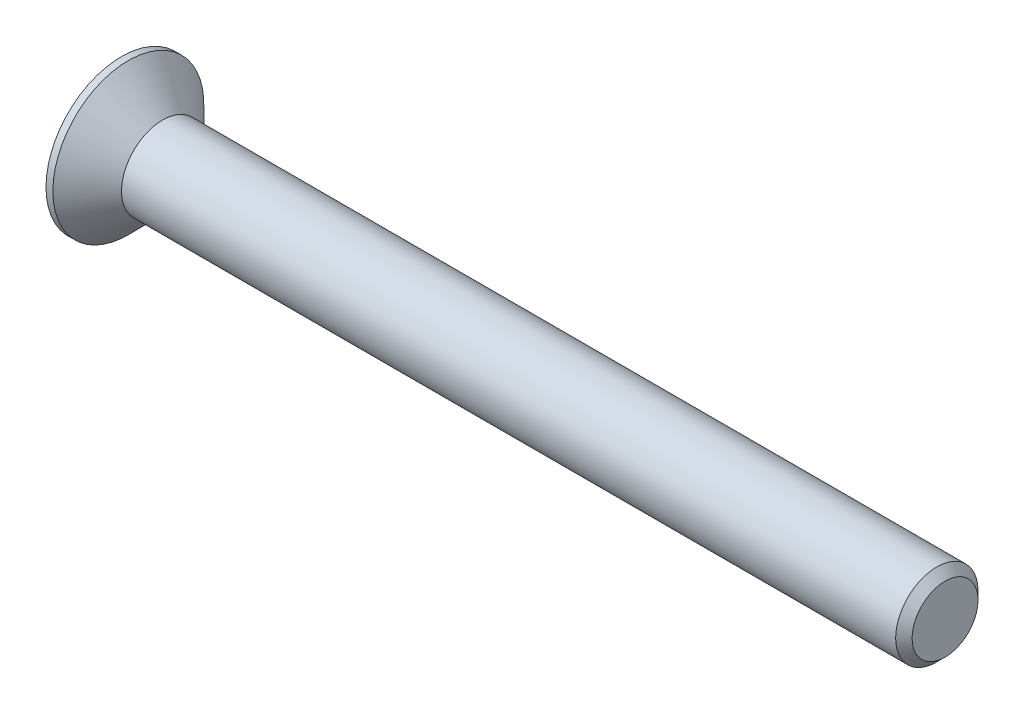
from build123d import *

# Parameters (mm, degrees)
CHAMFER1_SIZE      = 0.6
CUT_EXTRUDE1_DEPTH = 2.5


with BuildPart() as part:
    # Sketch1 → Revolve1 (revolve)
    with BuildSketch(Plane.XY, mode=Mode.PRIVATE) as revolve1_sk:
        Polygon((-3, 5.5), (-3, 0), (57, 0), (57, 3), (0, 3), (-2.5, 5.5), align=None)
    revolve(revolve1_sk.sketch.rotate(Axis((-3, 0, 0), (1, 0, 0)), 90), axis=Axis((-3, 0, 0), (1, 0, 0)))

    # Chamfer1
    chamfer1_edges = [part.edges().sort_by_distance(p)[0] for p in [
        (57, 0, -3),
    ]]
    chamfer(chamfer1_edges, length=CHAMFER1_SIZE)

    # Sketch2 → Cut-Extrude1 (cut)
    with BuildSketch(Plane.ZY.offset(3)):
        Polygon((-0.825, 3.3), (0.825, 3.3), (0.825, 0.825), (3.3, 0.825), (3.3, -0.825), (0.825, -0.825), (0.825, -3.3), (-0.825, -3.3), (-0.825, -0.825), (-3.3, -0.825), (-3.3, 0.825), (-0.825, 0.825), align=None)
    extrude(amount=-CUT_EXTRUDE1_DEPTH, mode=Mode.SUBTRACT)


solid = part.part
